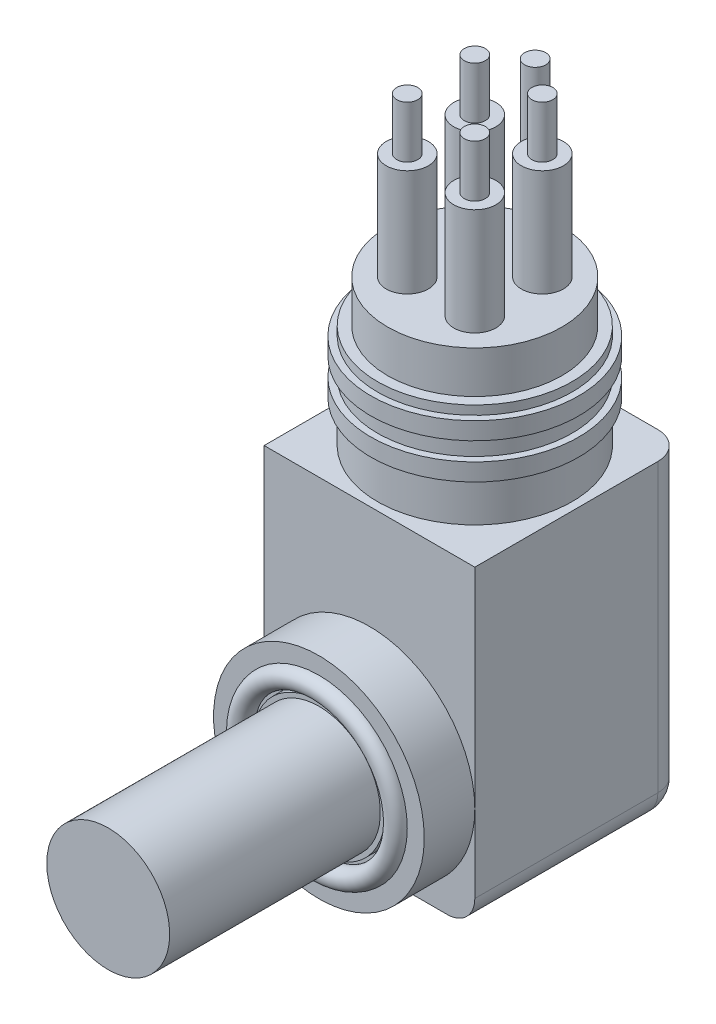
ISO-10303-21;
HEADER;
FILE_DESCRIPTION(('STEP AP214'),'2;1');
FILE_NAME('part.step','',(''),(''),'','','');
FILE_SCHEMA(('AUTOMOTIVE_DESIGN { 1 0 10303 214 1 1 1 1 }'));
ENDSEC;
DATA;
#1=APPLICATION_CONTEXT('core data for automotive mechanical design processes');
#2=APPLICATION_PROTOCOL_DEFINITION('international standard','automotive_design',2000,#1);
#3=PRODUCT_CONTEXT('',#1,'mechanical');
#4=PRODUCT('Part','Part','',(#3));
#5=PRODUCT_RELATED_PRODUCT_CATEGORY('part','',(#4));
#6=PRODUCT_DEFINITION_FORMATION('','',#4);
#7=PRODUCT_DEFINITION_CONTEXT('part definition',#1,'design');
#8=PRODUCT_DEFINITION('design','',#6,#7);
#9=PRODUCT_DEFINITION_SHAPE('','',#8);
#10=(LENGTH_UNIT() NAMED_UNIT(*) SI_UNIT(.MILLI.,.METRE.));
#11=(NAMED_UNIT(*) PLANE_ANGLE_UNIT() SI_UNIT($,.RADIAN.));
#12=(NAMED_UNIT(*) SI_UNIT($,.STERADIAN.) SOLID_ANGLE_UNIT());
#13=UNCERTAINTY_MEASURE_WITH_UNIT(LENGTH_MEASURE(1.E-05),#10,'distance_accuracy_value','');
#14=(GEOMETRIC_REPRESENTATION_CONTEXT(3) GLOBAL_UNCERTAINTY_ASSIGNED_CONTEXT((#13)) GLOBAL_UNIT_ASSIGNED_CONTEXT((#10,
#11,#12)) REPRESENTATION_CONTEXT('',''));
#15=CARTESIAN_POINT('',(0.,0.,0.));
#16=DIRECTION('',(0.,0.,1.));
#17=DIRECTION('',(1.,0.,0.));
#18=AXIS2_PLACEMENT_3D('',#15,#16,#17);
#19=CARTESIAN_POINT('',(0.,9.525,14.097));
#20=DIRECTION('',(0.,0.,1.));
#21=DIRECTION('',(1.,0.,0.));
#22=AXIS2_PLACEMENT_3D('',#19,#20,#21);
#23=PLANE('',#22);
#24=CARTESIAN_POINT('',(0.,9.525,14.097));
#25=DIRECTION('',(0.,0.,1.));
#26=DIRECTION('',(1.,0.,0.));
#27=AXIS2_PLACEMENT_3D('',#24,#25,#26);
#28=CIRCLE('',#27,9.525);
#29=CARTESIAN_POINT('',(9.525,9.525,14.097));
#30=VERTEX_POINT('',#29);
#31=EDGE_CURVE('E143',#30,#30,#28,.T.);
#32=ORIENTED_EDGE('',*,*,#31,.T.);
#33=EDGE_LOOP('',(#32));
#34=FACE_BOUND('',#33,.T.);
#35=CARTESIAN_POINT('',(0.,9.525,14.097));
#36=DIRECTION('',(0.,0.,1.));
#37=DIRECTION('',(1.,0.,0.));
#38=AXIS2_PLACEMENT_3D('',#35,#36,#37);
#39=CIRCLE('',#38,7.99);
#40=CARTESIAN_POINT('',(7.99,9.525,14.097));
#41=VERTEX_POINT('',#40);
#42=EDGE_CURVE('E318',#41,#41,#39,.F.);
#43=ORIENTED_EDGE('',*,*,#42,.T.);
#44=EDGE_LOOP('',(#43));
#45=FACE_BOUND('',#44,.T.);
#46=ADVANCED_FACE('F38',(#34,#45),#23,.T.);
#47=CARTESIAN_POINT('',(-9.525,28.448,9.525));
#48=DIRECTION('',(0.,0.,-1.));
#49=DIRECTION('',(-1.,0.,0.));
#50=AXIS2_PLACEMENT_3D('',#47,#48,#49);
#51=PLANE('',#50);
#52=CARTESIAN_POINT('',(0.,9.525,9.525));
#53=DIRECTION('',(0.,0.,1.));
#54=DIRECTION('',(1.,0.,0.));
#55=AXIS2_PLACEMENT_3D('',#52,#53,#54);
#56=CIRCLE('',#55,9.525);
#57=CARTESIAN_POINT('',(9.525,9.525,9.525));
#58=VERTEX_POINT('',#57);
#59=CARTESIAN_POINT('',(-9.525,9.525,9.525));
#60=VERTEX_POINT('',#59);
#61=EDGE_CURVE('E137',#58,#60,#56,.T.);
#62=ORIENTED_EDGE('',*,*,#61,.F.);
#63=DIRECTION('',(0.,-1.,0.));
#64=VECTOR('',#63,1.);
#65=CARTESIAN_POINT('',(9.525,28.448,9.525));
#66=LINE('',#65,#64);
#67=CARTESIAN_POINT('',(9.525,28.448,9.525));
#68=VERTEX_POINT('',#67);
#69=EDGE_CURVE('E112',#68,#58,#66,.T.);
#70=ORIENTED_EDGE('',*,*,#69,.F.);
#71=DIRECTION('',(1.,0.,0.));
#72=VECTOR('',#71,1.);
#73=CARTESIAN_POINT('',(-9.525,28.448,9.525));
#74=LINE('',#73,#72);
#75=CARTESIAN_POINT('',(-9.525,28.448,9.525));
#76=VERTEX_POINT('',#75);
#77=EDGE_CURVE('E249',#76,#68,#74,.T.);
#78=ORIENTED_EDGE('',*,*,#77,.F.);
#79=DIRECTION('',(0.,-1.,0.));
#80=VECTOR('',#79,1.);
#81=CARTESIAN_POINT('',(-9.525,28.448,9.525));
#82=LINE('',#81,#80);
#83=EDGE_CURVE('E140',#76,#60,#82,.T.);
#84=ORIENTED_EDGE('',*,*,#83,.T.);
#85=EDGE_LOOP('',(#62,#70,#78,#84));
#86=FACE_BOUND('',#85,.T.);
#87=ADVANCED_FACE('F138',(#86),#51,.F.);
#88=CARTESIAN_POINT('',(-9.525,2.5,9.525));
#89=VERTEX_POINT('',#88);
#90=EDGE_CURVE('E123',#60,#89,#82,.T.);
#91=ORIENTED_EDGE('',*,*,#90,.T.);
#92=CARTESIAN_POINT('',(-7.025,2.5,9.525));
#93=DIRECTION('',(0.,0.,-1.));
#94=DIRECTION('',(-1.,0.,0.));
#95=AXIS2_PLACEMENT_3D('',#92,#93,#94);
#96=CIRCLE('',#95,2.5);
#97=CARTESIAN_POINT('',(-7.025,0.,9.525));
#98=VERTEX_POINT('',#97);
#99=EDGE_CURVE('E279',#89,#98,#96,.F.);
#100=ORIENTED_EDGE('',*,*,#99,.T.);
#101=DIRECTION('',(1.,0.,0.));
#102=VECTOR('',#101,1.);
#103=CARTESIAN_POINT('',(-9.525,0.,9.525));
#104=LINE('',#103,#102);
#105=CARTESIAN_POINT('',(0.,0.,9.525));
#106=VERTEX_POINT('',#105);
#107=EDGE_CURVE('E245',#98,#106,#104,.T.);
#108=ORIENTED_EDGE('',*,*,#107,.T.);
#109=EDGE_CURVE('E146',#60,#106,#56,.T.);
#110=ORIENTED_EDGE('',*,*,#109,.F.);
#111=EDGE_LOOP('',(#91,#100,#108,#110));
#112=FACE_BOUND('',#111,.T.);
#113=ADVANCED_FACE('F366',(#112),#51,.F.);
#114=CARTESIAN_POINT('',(7.025,0.,9.525));
#115=VERTEX_POINT('',#114);
#116=EDGE_CURVE('E244',#106,#115,#104,.T.);
#117=ORIENTED_EDGE('',*,*,#116,.T.);
#118=CARTESIAN_POINT('',(7.025,2.5,9.525));
#119=DIRECTION('',(0.,0.,-1.));
#120=DIRECTION('',(-1.,0.,0.));
#121=AXIS2_PLACEMENT_3D('',#118,#119,#120);
#122=CIRCLE('',#121,2.5);
#123=CARTESIAN_POINT('',(9.525,2.5,9.525));
#124=VERTEX_POINT('',#123);
#125=EDGE_CURVE('E133',#115,#124,#122,.F.);
#126=ORIENTED_EDGE('',*,*,#125,.T.);
#127=EDGE_CURVE('E116',#58,#124,#66,.T.);
#128=ORIENTED_EDGE('',*,*,#127,.F.);
#129=EDGE_CURVE('E130',#106,#58,#56,.T.);
#130=ORIENTED_EDGE('',*,*,#129,.F.);
#131=EDGE_LOOP('',(#117,#126,#128,#130));
#132=FACE_BOUND('',#131,.T.);
#133=ADVANCED_FACE('F128',(#132),#51,.F.);
#134=CARTESIAN_POINT('',(0.,41.656,0.));
#135=DIRECTION('',(0.,1.,0.));
#136=DIRECTION('',(-1.,0.,0.));
#137=AXIS2_PLACEMENT_3D('',#134,#135,#136);
#138=PLANE('',#137);
#139=CARTESIAN_POINT('',(3.05328708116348,41.656,3.05328708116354));
#140=DIRECTION('',(0.,1.,0.));
#141=DIRECTION('',(0.,0.,1.));
#142=AXIS2_PLACEMENT_3D('',#139,#140,#141);
#143=CIRCLE('',#142,1.905);
#144=CARTESIAN_POINT('',(3.05328708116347,41.656,4.95828708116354));
#145=VERTEX_POINT('',#144);
#146=EDGE_CURVE('E163',#145,#145,#143,.T.);
#147=ORIENTED_EDGE('',*,*,#146,.F.);
#148=EDGE_LOOP('',(#147));
#149=FACE_BOUND('',#148,.T.);
#150=CARTESIAN_POINT('',(-3.0532870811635,41.656,-3.05328708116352));
#151=DIRECTION('',(0.,1.,0.));
#152=DIRECTION('',(0.,0.,-1.));
#153=AXIS2_PLACEMENT_3D('',#150,#151,#152);
#154=CIRCLE('',#153,1.905);
#155=CARTESIAN_POINT('',(-3.0532870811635,41.656,-4.95828708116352));
#156=VERTEX_POINT('',#155);
#157=EDGE_CURVE('E187',#156,#156,#154,.T.);
#158=ORIENTED_EDGE('',*,*,#157,.F.);
#159=EDGE_LOOP('',(#158));
#160=FACE_BOUND('',#159,.T.);
#161=CARTESIAN_POINT('',(0.,41.656,0.));
#162=DIRECTION('',(0.,1.,0.));
#163=DIRECTION('',(-1.,0.,0.));
#164=AXIS2_PLACEMENT_3D('',#161,#162,#163);
#165=CIRCLE('',#164,7.874);
#166=CARTESIAN_POINT('',(-7.874,41.656,0.));
#167=VERTEX_POINT('',#166);
#168=EDGE_CURVE('E211',#167,#167,#165,.T.);
#169=ORIENTED_EDGE('',*,*,#168,.T.);
#170=EDGE_LOOP('',(#169));
#171=FACE_BOUND('',#170,.T.);
#172=CARTESIAN_POINT('',(-3.05328708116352,41.656,3.05328708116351));
#173=DIRECTION('',(0.,1.,0.));
#174=DIRECTION('',(-1.,0.,0.));
#175=AXIS2_PLACEMENT_3D('',#172,#173,#174);
#176=CIRCLE('',#175,1.905);
#177=CARTESIAN_POINT('',(-4.95828708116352,41.656,3.05328708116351));
#178=VERTEX_POINT('',#177);
#179=EDGE_CURVE('E205',#178,#178,#176,.T.);
#180=ORIENTED_EDGE('',*,*,#179,.F.);
#181=EDGE_LOOP('',(#180));
#182=FACE_BOUND('',#181,.T.);
#183=CARTESIAN_POINT('',(3.05328708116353,41.656,-3.05328708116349));
#184=DIRECTION('',(0.,1.,0.));
#185=DIRECTION('',(1.,0.,0.));
#186=AXIS2_PLACEMENT_3D('',#183,#184,#185);
#187=CIRCLE('',#186,1.905);
#188=CARTESIAN_POINT('',(4.95828708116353,41.656,-3.05328708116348));
#189=VERTEX_POINT('',#188);
#190=EDGE_CURVE('E175',#189,#189,#187,.T.);
#191=ORIENTED_EDGE('',*,*,#190,.F.);
#192=EDGE_LOOP('',(#191));
#193=FACE_BOUND('',#192,.T.);
#194=CARTESIAN_POINT('',(0.,41.656,-5.45820252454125));
#195=DIRECTION('',(0.,1.,0.));
#196=DIRECTION('',(-1.,0.,0.));
#197=AXIS2_PLACEMENT_3D('',#194,#195,#196);
#198=CIRCLE('',#197,0.9525);
#199=CARTESIAN_POINT('',(-0.952500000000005,41.656,-5.45820252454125));
#200=VERTEX_POINT('',#199);
#201=EDGE_CURVE('E157',#200,#200,#198,.T.);
#202=ORIENTED_EDGE('',*,*,#201,.F.);
#203=EDGE_LOOP('',(#202));
#204=FACE_BOUND('',#203,.T.);
#205=ADVANCED_FACE('F517',(#149,#160,#171,#182,#193,#204),#138,.T.);
#206=CARTESIAN_POINT('',(-3.05328708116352,51.308,3.05328708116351));
#207=DIRECTION('',(0.,1.,0.));
#208=DIRECTION('',(-1.,0.,0.));
#209=AXIS2_PLACEMENT_3D('',#206,#207,#208);
#210=PLANE('',#209);
#211=CARTESIAN_POINT('',(-3.05328708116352,51.308,3.05328708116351));
#212=DIRECTION('',(0.,1.,0.));
#213=DIRECTION('',(-1.,0.,0.));
#214=AXIS2_PLACEMENT_3D('',#211,#212,#213);
#215=CIRCLE('',#214,1.905);
#216=CARTESIAN_POINT('',(-4.95828708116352,51.308,3.05328708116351));
#217=VERTEX_POINT('',#216);
#218=EDGE_CURVE('E208',#217,#217,#215,.T.);
#219=ORIENTED_EDGE('',*,*,#218,.T.);
#220=EDGE_LOOP('',(#219));
#221=FACE_BOUND('',#220,.T.);
#222=CARTESIAN_POINT('',(-3.05328708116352,51.308,3.05328708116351));
#223=DIRECTION('',(0.,1.,0.));
#224=DIRECTION('',(-1.,0.,0.));
#225=AXIS2_PLACEMENT_3D('',#222,#223,#224);
#226=CIRCLE('',#225,0.9525);
#227=CARTESIAN_POINT('',(-4.00578708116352,51.308,3.05328708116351));
#228=VERTEX_POINT('',#227);
#229=EDGE_CURVE('E199',#228,#228,#226,.T.);
#230=ORIENTED_EDGE('',*,*,#229,.F.);
#231=EDGE_LOOP('',(#230));
#232=FACE_BOUND('',#231,.T.);
#233=ADVANCED_FACE('F543',(#221,#232),#210,.T.);
#234=CARTESIAN_POINT('',(8.8011,37.846,0.));
#235=DIRECTION('',(0.,-1.,0.));
#236=DIRECTION('',(1.,0.,0.));
#237=AXIS2_PLACEMENT_3D('',#234,#235,#236);
#238=PLANE('',#237);
#239=CARTESIAN_POINT('',(0.,37.846,0.));
#240=DIRECTION('',(0.,1.,0.));
#241=DIRECTION('',(-1.,0.,0.));
#242=AXIS2_PLACEMENT_3D('',#239,#240,#241);
#243=CIRCLE('',#242,8.8011);
#244=CARTESIAN_POINT('',(-8.80110000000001,37.846,0.));
#245=VERTEX_POINT('',#244);
#246=EDGE_CURVE('E241',#245,#245,#243,.T.);
#247=ORIENTED_EDGE('',*,*,#246,.T.);
#248=EDGE_LOOP('',(#247));
#249=FACE_BOUND('',#248,.T.);
#250=CARTESIAN_POINT('',(0.,37.846,0.));
#251=DIRECTION('',(0.,-1.,0.));
#252=DIRECTION('',(1.,0.,0.));
#253=AXIS2_PLACEMENT_3D('',#250,#251,#252);
#254=CIRCLE('',#253,7.874);
#255=CARTESIAN_POINT('',(7.87399999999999,37.846,0.));
#256=VERTEX_POINT('',#255);
#257=EDGE_CURVE('E148',#256,#256,#254,.F.);
#258=ORIENTED_EDGE('',*,*,#257,.F.);
#259=EDGE_LOOP('',(#258));
#260=FACE_BOUND('',#259,.T.);
#261=ADVANCED_FACE('F689',(#249,#260),#238,.F.);
#262=CARTESIAN_POINT('',(-9.525,28.448,-9.525));
#263=DIRECTION('',(0.,1.,0.));
#264=DIRECTION('',(0.,0.,1.));
#265=AXIS2_PLACEMENT_3D('',#262,#263,#264);
#266=PLANE('',#265);
#267=DIRECTION('',(-1.,0.,0.));
#268=VECTOR('',#267,1.);
#269=CARTESIAN_POINT('',(-9.525,28.448,-9.525));
#270=LINE('',#269,#268);
#271=CARTESIAN_POINT('',(7.02499999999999,28.448,-9.525));
#272=VERTEX_POINT('',#271);
#273=CARTESIAN_POINT('',(-7.025,28.448,-9.525));
#274=VERTEX_POINT('',#273);
#275=EDGE_CURVE('E134',#272,#274,#270,.T.);
#276=ORIENTED_EDGE('',*,*,#275,.T.);
#277=CARTESIAN_POINT('',(-7.025,28.448,-7.025));
#278=DIRECTION('',(0.,1.,0.));
#279=DIRECTION('',(0.,0.,1.));
#280=AXIS2_PLACEMENT_3D('',#277,#278,#279);
#281=CIRCLE('',#280,2.5);
#282=CARTESIAN_POINT('',(-9.525,28.448,-7.025));
#283=VERTEX_POINT('',#282);
#284=EDGE_CURVE('E11',#274,#283,#281,.T.);
#285=ORIENTED_EDGE('',*,*,#284,.T.);
#286=DIRECTION('',(0.,0.,1.));
#287=VECTOR('',#286,1.);
#288=CARTESIAN_POINT('',(-9.525,28.448,-9.525));
#289=LINE('',#288,#287);
#290=EDGE_CURVE('E247',#283,#76,#289,.T.);
#291=ORIENTED_EDGE('',*,*,#290,.T.);
#292=ORIENTED_EDGE('',*,*,#77,.T.);
#293=DIRECTION('',(0.,0.,-1.));
#294=VECTOR('',#293,1.);
#295=CARTESIAN_POINT('',(9.525,28.448,-9.525));
#296=LINE('',#295,#294);
#297=CARTESIAN_POINT('',(9.525,28.448,-7.025));
#298=VERTEX_POINT('',#297);
#299=EDGE_CURVE('E119',#68,#298,#296,.T.);
#300=ORIENTED_EDGE('',*,*,#299,.T.);
#301=CARTESIAN_POINT('',(7.025,28.448,-7.025));
#302=DIRECTION('',(0.,1.,0.));
#303=DIRECTION('',(0.,0.,1.));
#304=AXIS2_PLACEMENT_3D('',#301,#302,#303);
#305=CIRCLE('',#304,2.5);
#306=EDGE_CURVE('E46',#298,#272,#305,.T.);
#307=ORIENTED_EDGE('',*,*,#306,.T.);
#308=EDGE_LOOP('',(#276,#285,#291,#292,#300,#307));
#309=FACE_BOUND('',#308,.T.);
#310=CARTESIAN_POINT('',(0.,28.448,0.));
#311=DIRECTION('',(0.,1.,0.));
#312=DIRECTION('',(-1.,0.,0.));
#313=AXIS2_PLACEMENT_3D('',#310,#311,#312);
#314=CIRCLE('',#313,8.8011);
#315=CARTESIAN_POINT('',(-8.80110000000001,28.448,0.));
#316=VERTEX_POINT('',#315);
#317=EDGE_CURVE('E214',#316,#316,#314,.T.);
#318=ORIENTED_EDGE('',*,*,#317,.F.);
#319=EDGE_LOOP('',(#318));
#320=FACE_BOUND('',#319,.T.);
#321=ADVANCED_FACE('F282',(#309,#320),#266,.T.);
#322=CARTESIAN_POINT('',(-9.525,28.448,-9.525));
#323=DIRECTION('',(1.,0.,0.));
#324=DIRECTION('',(0.,0.,-1.));
#325=AXIS2_PLACEMENT_3D('',#322,#323,#324);
#326=PLANE('',#325);
#327=DIRECTION('',(0.,-1.,0.));
#328=VECTOR('',#327,1.);
#329=CARTESIAN_POINT('',(-9.525,28.448,-7.025));
#330=LINE('',#329,#328);
#331=CARTESIAN_POINT('',(-9.525,2.5,-7.025));
#332=VERTEX_POINT('',#331);
#333=EDGE_CURVE('E53',#283,#332,#330,.T.);
#334=ORIENTED_EDGE('',*,*,#333,.T.);
#335=DIRECTION('',(0.,0.,1.));
#336=VECTOR('',#335,1.);
#337=CARTESIAN_POINT('',(-9.525,2.5,-9.525));
#338=LINE('',#337,#336);
#339=EDGE_CURVE('E277',#332,#89,#338,.T.);
#340=ORIENTED_EDGE('',*,*,#339,.T.);
#341=ORIENTED_EDGE('',*,*,#90,.F.);
#342=ORIENTED_EDGE('',*,*,#83,.F.);
#343=ORIENTED_EDGE('',*,*,#290,.F.);
#344=EDGE_LOOP('',(#334,#340,#341,#342,#343));
#345=FACE_BOUND('',#344,.T.);
#346=ADVANCED_FACE('F40',(#345),#326,.F.);
#347=CARTESIAN_POINT('',(9.525,28.448,-9.525));
#348=DIRECTION('',(-1.,0.,0.));
#349=DIRECTION('',(0.,0.,1.));
#350=AXIS2_PLACEMENT_3D('',#347,#348,#349);
#351=PLANE('',#350);
#352=ORIENTED_EDGE('',*,*,#127,.T.);
#353=DIRECTION('',(0.,0.,-1.));
#354=VECTOR('',#353,1.);
#355=CARTESIAN_POINT('',(9.525,2.5,-9.525));
#356=LINE('',#355,#354);
#357=CARTESIAN_POINT('',(9.525,2.5,-7.025));
#358=VERTEX_POINT('',#357);
#359=EDGE_CURVE('E261',#124,#358,#356,.T.);
#360=ORIENTED_EDGE('',*,*,#359,.T.);
#361=DIRECTION('',(0.,-1.,0.));
#362=VECTOR('',#361,1.);
#363=CARTESIAN_POINT('',(9.525,28.448,-7.025));
#364=LINE('',#363,#362);
#365=EDGE_CURVE('E259',#358,#298,#364,.F.);
#366=ORIENTED_EDGE('',*,*,#365,.T.);
#367=ORIENTED_EDGE('',*,*,#299,.F.);
#368=ORIENTED_EDGE('',*,*,#69,.T.);
#369=EDGE_LOOP('',(#352,#360,#366,#367,#368));
#370=FACE_BOUND('',#369,.T.);
#371=ADVANCED_FACE('F114',(#370),#351,.F.);
#372=CARTESIAN_POINT('',(-9.525,28.448,-9.525));
#373=DIRECTION('',(0.,0.,1.));
#374=DIRECTION('',(1.,0.,0.));
#375=AXIS2_PLACEMENT_3D('',#372,#373,#374);
#376=PLANE('',#375);
#377=DIRECTION('',(-1.,0.,0.));
#378=VECTOR('',#377,1.);
#379=CARTESIAN_POINT('',(-9.525,2.5,-9.525));
#380=LINE('',#379,#378);
#381=CARTESIAN_POINT('',(7.025,2.5,-9.525));
#382=VERTEX_POINT('',#381);
#383=CARTESIAN_POINT('',(-7.025,2.5,-9.525));
#384=VERTEX_POINT('',#383);
#385=EDGE_CURVE('E272',#382,#384,#380,.T.);
#386=ORIENTED_EDGE('',*,*,#385,.T.);
#387=DIRECTION('',(0.,-1.,0.));
#388=VECTOR('',#387,1.);
#389=CARTESIAN_POINT('',(-7.025,28.448,-9.525));
#390=LINE('',#389,#388);
#391=EDGE_CURVE('E274',#384,#274,#390,.F.);
#392=ORIENTED_EDGE('',*,*,#391,.T.);
#393=ORIENTED_EDGE('',*,*,#275,.F.);
#394=DIRECTION('',(0.,-1.,0.));
#395=VECTOR('',#394,1.);
#396=CARTESIAN_POINT('',(7.025,28.448,-9.525));
#397=LINE('',#396,#395);
#398=EDGE_CURVE('E270',#272,#382,#397,.T.);
#399=ORIENTED_EDGE('',*,*,#398,.T.);
#400=EDGE_LOOP('',(#386,#392,#393,#399));
#401=FACE_BOUND('',#400,.T.);
#402=ADVANCED_FACE('F288',(#401),#376,.F.);
#403=CARTESIAN_POINT('',(-9.525,0.,-9.525));
#404=DIRECTION('',(0.,1.,0.));
#405=DIRECTION('',(0.,0.,1.));
#406=AXIS2_PLACEMENT_3D('',#403,#404,#405);
#407=PLANE('',#406);
#408=DIRECTION('',(-1.,0.,0.));
#409=VECTOR('',#408,1.);
#410=CARTESIAN_POINT('',(-9.525,0.,-7.025));
#411=LINE('',#410,#409);
#412=CARTESIAN_POINT('',(-7.025,0.,-7.025));
#413=VERTEX_POINT('',#412);
#414=CARTESIAN_POINT('',(7.025,0.,-7.025));
#415=VERTEX_POINT('',#414);
#416=EDGE_CURVE('E265',#413,#415,#411,.F.);
#417=ORIENTED_EDGE('',*,*,#416,.T.);
#418=DIRECTION('',(0.,0.,-1.));
#419=VECTOR('',#418,1.);
#420=CARTESIAN_POINT('',(7.025,0.,-9.52500000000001));
#421=LINE('',#420,#419);
#422=EDGE_CURVE('E267',#415,#115,#421,.F.);
#423=ORIENTED_EDGE('',*,*,#422,.T.);
#424=ORIENTED_EDGE('',*,*,#116,.F.);
#425=ORIENTED_EDGE('',*,*,#107,.F.);
#426=DIRECTION('',(0.,0.,1.));
#427=VECTOR('',#426,1.);
#428=CARTESIAN_POINT('',(-7.025,0.,-9.525));
#429=LINE('',#428,#427);
#430=EDGE_CURVE('E263',#98,#413,#429,.F.);
#431=ORIENTED_EDGE('',*,*,#430,.T.);
#432=EDGE_LOOP('',(#417,#423,#424,#425,#431));
#433=FACE_BOUND('',#432,.T.);
#434=ADVANCED_FACE('F796',(#433),#407,.F.);
#435=CARTESIAN_POINT('',(0.,0.,0.));
#436=DIRECTION('',(0.,1.,0.));
#437=DIRECTION('',(-1.,0.,0.));
#438=AXIS2_PLACEMENT_3D('',#435,#436,#437);
#439=CYLINDRICAL_SURFACE('',#438,8.8011);
#440=ORIENTED_EDGE('',*,*,#246,.F.);
#441=EDGE_LOOP('',(#440));
#442=FACE_BOUND('',#441,.T.);
#443=CARTESIAN_POINT('',(0.,37.0332,0.));
#444=DIRECTION('',(0.,1.,0.));
#445=DIRECTION('',(-1.,0.,0.));
#446=AXIS2_PLACEMENT_3D('',#443,#444,#445);
#447=CIRCLE('',#446,8.8011);
#448=CARTESIAN_POINT('',(-8.80110000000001,37.0332,0.));
#449=VERTEX_POINT('',#448);
#450=EDGE_CURVE('E238',#449,#449,#447,.T.);
#451=ORIENTED_EDGE('',*,*,#450,.T.);
#452=EDGE_LOOP('',(#451));
#453=FACE_BOUND('',#452,.T.);
#454=ADVANCED_FACE('F787',(#442,#453),#439,.T.);
#455=CARTESIAN_POINT('',(9.398,37.0332,0.));
#456=DIRECTION('',(0.,-1.,0.));
#457=DIRECTION('',(1.,0.,0.));
#458=AXIS2_PLACEMENT_3D('',#455,#456,#457);
#459=PLANE('',#458);
#460=ORIENTED_EDGE('',*,*,#450,.F.);
#461=EDGE_LOOP('',(#460));
#462=FACE_BOUND('',#461,.T.);
#463=CARTESIAN_POINT('',(0.,37.0332,0.));
#464=DIRECTION('',(0.,1.,0.));
#465=DIRECTION('',(-1.,0.,0.));
#466=AXIS2_PLACEMENT_3D('',#463,#464,#465);
#467=CIRCLE('',#466,9.398);
#468=CARTESIAN_POINT('',(-9.39800000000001,37.0332,0.));
#469=VERTEX_POINT('',#468);
#470=EDGE_CURVE('E235',#469,#469,#467,.T.);
#471=ORIENTED_EDGE('',*,*,#470,.T.);
#472=EDGE_LOOP('',(#471));
#473=FACE_BOUND('',#472,.T.);
#474=ADVANCED_FACE('F778',(#462,#473),#459,.F.);
#475=CARTESIAN_POINT('',(0.,0.,0.));
#476=DIRECTION('',(0.,1.,0.));
#477=DIRECTION('',(-1.,0.,0.));
#478=AXIS2_PLACEMENT_3D('',#475,#476,#477);
#479=CYLINDRICAL_SURFACE('',#478,9.398);
#480=ORIENTED_EDGE('',*,*,#470,.F.);
#481=EDGE_LOOP('',(#480));
#482=FACE_BOUND('',#481,.T.);
#483=CARTESIAN_POINT('',(0.,35.4584000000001,0.));
#484=DIRECTION('',(0.,1.,0.));
#485=DIRECTION('',(-1.,0.,0.));
#486=AXIS2_PLACEMENT_3D('',#483,#484,#485);
#487=CIRCLE('',#486,9.398);
#488=CARTESIAN_POINT('',(-9.39800000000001,35.4584000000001,0.));
#489=VERTEX_POINT('',#488);
#490=EDGE_CURVE('E232',#489,#489,#487,.T.);
#491=ORIENTED_EDGE('',*,*,#490,.T.);
#492=EDGE_LOOP('',(#491));
#493=FACE_BOUND('',#492,.T.);
#494=ADVANCED_FACE('F769',(#482,#493),#479,.T.);
#495=CARTESIAN_POINT('',(8.8011,35.4584000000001,0.));
#496=DIRECTION('',(0.,1.,0.));
#497=DIRECTION('',(-1.,0.,0.));
#498=AXIS2_PLACEMENT_3D('',#495,#496,#497);
#499=PLANE('',#498);
#500=ORIENTED_EDGE('',*,*,#490,.F.);
#501=EDGE_LOOP('',(#500));
#502=FACE_BOUND('',#501,.T.);
#503=CARTESIAN_POINT('',(0.,35.4584000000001,0.));
#504=DIRECTION('',(0.,1.,0.));
#505=DIRECTION('',(-1.,0.,0.));
#506=AXIS2_PLACEMENT_3D('',#503,#504,#505);
#507=CIRCLE('',#506,8.8011);
#508=CARTESIAN_POINT('',(-8.80110000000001,35.4584000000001,0.));
#509=VERTEX_POINT('',#508);
#510=EDGE_CURVE('E229',#509,#509,#507,.T.);
#511=ORIENTED_EDGE('',*,*,#510,.T.);
#512=EDGE_LOOP('',(#511));
#513=FACE_BOUND('',#512,.T.);
#514=ADVANCED_FACE('F760',(#502,#513),#499,.F.);
#515=CARTESIAN_POINT('',(0.,0.,0.));
#516=DIRECTION('',(0.,1.,0.));
#517=DIRECTION('',(-1.,0.,0.));
#518=AXIS2_PLACEMENT_3D('',#515,#516,#517);
#519=CYLINDRICAL_SURFACE('',#518,8.8011);
#520=ORIENTED_EDGE('',*,*,#510,.F.);
#521=EDGE_LOOP('',(#520));
#522=FACE_BOUND('',#521,.T.);
#523=CARTESIAN_POINT('',(0.,33.8074000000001,0.));
#524=DIRECTION('',(0.,1.,0.));
#525=DIRECTION('',(-1.,0.,0.));
#526=AXIS2_PLACEMENT_3D('',#523,#524,#525);
#527=CIRCLE('',#526,8.8011);
#528=CARTESIAN_POINT('',(-8.8011,33.8074000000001,0.));
#529=VERTEX_POINT('',#528);
#530=EDGE_CURVE('E226',#529,#529,#527,.T.);
#531=ORIENTED_EDGE('',*,*,#530,.T.);
#532=EDGE_LOOP('',(#531));
#533=FACE_BOUND('',#532,.T.);
#534=ADVANCED_FACE('F751',(#522,#533),#519,.T.);
#535=CARTESIAN_POINT('',(9.398,33.8074000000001,0.));
#536=DIRECTION('',(0.,-1.,0.));
#537=DIRECTION('',(1.,0.,0.));
#538=AXIS2_PLACEMENT_3D('',#535,#536,#537);
#539=PLANE('',#538);
#540=ORIENTED_EDGE('',*,*,#530,.F.);
#541=EDGE_LOOP('',(#540));
#542=FACE_BOUND('',#541,.T.);
#543=CARTESIAN_POINT('',(0.,33.8074000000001,0.));
#544=DIRECTION('',(0.,1.,0.));
#545=DIRECTION('',(-1.,0.,0.));
#546=AXIS2_PLACEMENT_3D('',#543,#544,#545);
#547=CIRCLE('',#546,9.398);
#548=CARTESIAN_POINT('',(-9.398,33.8074000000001,0.));
#549=VERTEX_POINT('',#548);
#550=EDGE_CURVE('E223',#549,#549,#547,.T.);
#551=ORIENTED_EDGE('',*,*,#550,.T.);
#552=EDGE_LOOP('',(#551));
#553=FACE_BOUND('',#552,.T.);
#554=ADVANCED_FACE('F742',(#542,#553),#539,.F.);
#555=CARTESIAN_POINT('',(0.,0.,0.));
#556=DIRECTION('',(0.,1.,0.));
#557=DIRECTION('',(-1.,0.,0.));
#558=AXIS2_PLACEMENT_3D('',#555,#556,#557);
#559=CYLINDRICAL_SURFACE('',#558,9.398);
#560=ORIENTED_EDGE('',*,*,#550,.F.);
#561=EDGE_LOOP('',(#560));
#562=FACE_BOUND('',#561,.T.);
#563=CARTESIAN_POINT('',(0.,32.2326000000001,0.));
#564=DIRECTION('',(0.,1.,0.));
#565=DIRECTION('',(-1.,0.,0.));
#566=AXIS2_PLACEMENT_3D('',#563,#564,#565);
#567=CIRCLE('',#566,9.398);
#568=CARTESIAN_POINT('',(-9.398,32.2326000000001,0.));
#569=VERTEX_POINT('',#568);
#570=EDGE_CURVE('E220',#569,#569,#567,.T.);
#571=ORIENTED_EDGE('',*,*,#570,.T.);
#572=EDGE_LOOP('',(#571));
#573=FACE_BOUND('',#572,.T.);
#574=ADVANCED_FACE('F733',(#562,#573),#559,.T.);
#575=CARTESIAN_POINT('',(8.8011,32.2326000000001,0.));
#576=DIRECTION('',(0.,1.,0.));
#577=DIRECTION('',(-1.,0.,0.));
#578=AXIS2_PLACEMENT_3D('',#575,#576,#577);
#579=PLANE('',#578);
#580=ORIENTED_EDGE('',*,*,#570,.F.);
#581=EDGE_LOOP('',(#580));
#582=FACE_BOUND('',#581,.T.);
#583=CARTESIAN_POINT('',(0.,32.2326000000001,0.));
#584=DIRECTION('',(0.,1.,0.));
#585=DIRECTION('',(-1.,0.,0.));
#586=AXIS2_PLACEMENT_3D('',#583,#584,#585);
#587=CIRCLE('',#586,8.8011);
#588=CARTESIAN_POINT('',(-8.80110000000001,32.2326000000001,0.));
#589=VERTEX_POINT('',#588);
#590=EDGE_CURVE('E217',#589,#589,#587,.T.);
#591=ORIENTED_EDGE('',*,*,#590,.T.);
#592=EDGE_LOOP('',(#591));
#593=FACE_BOUND('',#592,.T.);
#594=ADVANCED_FACE('F724',(#582,#593),#579,.F.);
#595=CARTESIAN_POINT('',(0.,0.,0.));
#596=DIRECTION('',(0.,1.,0.));
#597=DIRECTION('',(-1.,0.,0.));
#598=AXIS2_PLACEMENT_3D('',#595,#596,#597);
#599=CYLINDRICAL_SURFACE('',#598,8.8011);
#600=ORIENTED_EDGE('',*,*,#590,.F.);
#601=EDGE_LOOP('',(#600));
#602=FACE_BOUND('',#601,.T.);
#603=ORIENTED_EDGE('',*,*,#317,.T.);
#604=EDGE_LOOP('',(#603));
#605=FACE_BOUND('',#604,.T.);
#606=ADVANCED_FACE('F707',(#602,#605),#599,.T.);
#607=CARTESIAN_POINT('',(0.,41.656,0.));
#608=DIRECTION('',(0.,-1.,0.));
#609=DIRECTION('',(1.,0.,0.));
#610=AXIS2_PLACEMENT_3D('',#607,#608,#609);
#611=CYLINDRICAL_SURFACE('',#610,7.874);
#612=ORIENTED_EDGE('',*,*,#168,.F.);
#613=EDGE_LOOP('',(#612));
#614=FACE_BOUND('',#613,.T.);
#615=ORIENTED_EDGE('',*,*,#257,.T.);
#616=EDGE_LOOP('',(#615));
#617=FACE_BOUND('',#616,.T.);
#618=ADVANCED_FACE('F698',(#614,#617),#611,.T.);
#619=CARTESIAN_POINT('',(-3.05328708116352,51.308,3.05328708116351));
#620=DIRECTION('',(0.,-1.,0.));
#621=DIRECTION('',(1.,0.,0.));
#622=AXIS2_PLACEMENT_3D('',#619,#620,#621);
#623=CYLINDRICAL_SURFACE('',#622,1.905);
#624=ORIENTED_EDGE('',*,*,#218,.F.);
#625=EDGE_LOOP('',(#624));
#626=FACE_BOUND('',#625,.T.);
#627=ORIENTED_EDGE('',*,*,#179,.T.);
#628=EDGE_LOOP('',(#627));
#629=FACE_BOUND('',#628,.T.);
#630=ADVANCED_FACE('F680',(#626,#629),#623,.T.);
#631=CARTESIAN_POINT('',(-3.05328708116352,56.007,3.05328708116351));
#632=DIRECTION('',(0.,-1.,0.));
#633=DIRECTION('',(1.,0.,0.));
#634=AXIS2_PLACEMENT_3D('',#631,#632,#633);
#635=CYLINDRICAL_SURFACE('',#634,0.9525);
#636=CARTESIAN_POINT('',(-3.05328708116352,56.007,3.05328708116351));
#637=DIRECTION('',(0.,1.,0.));
#638=DIRECTION('',(-1.,0.,0.));
#639=AXIS2_PLACEMENT_3D('',#636,#637,#638);
#640=CIRCLE('',#639,0.9525);
#641=CARTESIAN_POINT('',(-4.00578708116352,56.007,3.05328708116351));
#642=VERTEX_POINT('',#641);
#643=EDGE_CURVE('E202',#642,#642,#640,.T.);
#644=ORIENTED_EDGE('',*,*,#643,.F.);
#645=EDGE_LOOP('',(#644));
#646=FACE_BOUND('',#645,.T.);
#647=ORIENTED_EDGE('',*,*,#229,.T.);
#648=EDGE_LOOP('',(#647));
#649=FACE_BOUND('',#648,.T.);
#650=ADVANCED_FACE('F671',(#646,#649),#635,.T.);
#651=CARTESIAN_POINT('',(-3.05328708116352,56.007,3.05328708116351));
#652=DIRECTION('',(0.,1.,0.));
#653=DIRECTION('',(-1.,0.,0.));
#654=AXIS2_PLACEMENT_3D('',#651,#652,#653);
#655=PLANE('',#654);
#656=ORIENTED_EDGE('',*,*,#643,.T.);
#657=EDGE_LOOP('',(#656));
#658=FACE_BOUND('',#657,.T.);
#659=ADVANCED_FACE('F635',(#658),#655,.T.);
#660=CARTESIAN_POINT('',(-3.05328708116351,51.308,-3.05328708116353));
#661=DIRECTION('',(0.,-1.,0.));
#662=DIRECTION('',(0.,0.,1.));
#663=AXIS2_PLACEMENT_3D('',#660,#661,#662);
#664=CYLINDRICAL_SURFACE('',#663,1.905);
#665=CARTESIAN_POINT('',(-3.05328708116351,51.308,-3.05328708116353));
#666=DIRECTION('',(0.,1.,0.));
#667=DIRECTION('',(0.,0.,-1.));
#668=AXIS2_PLACEMENT_3D('',#665,#666,#667);
#669=CIRCLE('',#668,1.905);
#670=CARTESIAN_POINT('',(-3.0532870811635,51.308,-4.95828708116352));
#671=VERTEX_POINT('',#670);
#672=EDGE_CURVE('E196',#671,#671,#669,.T.);
#673=ORIENTED_EDGE('',*,*,#672,.F.);
#674=EDGE_LOOP('',(#673));
#675=FACE_BOUND('',#674,.T.);
#676=ORIENTED_EDGE('',*,*,#157,.T.);
#677=EDGE_LOOP('',(#676));
#678=FACE_BOUND('',#677,.T.);
#679=ADVANCED_FACE('F595',(#675,#678),#664,.T.);
#680=CARTESIAN_POINT('',(-3.05328708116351,51.308,-3.05328708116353));
#681=DIRECTION('',(0.,1.,0.));
#682=DIRECTION('',(0.,0.,-1.));
#683=AXIS2_PLACEMENT_3D('',#680,#681,#682);
#684=PLANE('',#683);
#685=ORIENTED_EDGE('',*,*,#672,.T.);
#686=EDGE_LOOP('',(#685));
#687=FACE_BOUND('',#686,.T.);
#688=CARTESIAN_POINT('',(-3.05328708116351,51.308,-3.05328708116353));
#689=DIRECTION('',(0.,1.,0.));
#690=DIRECTION('',(0.,0.,-1.));
#691=AXIS2_PLACEMENT_3D('',#688,#689,#690);
#692=CIRCLE('',#691,0.9525);
#693=CARTESIAN_POINT('',(-3.0532870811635,51.308,-4.00578708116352));
#694=VERTEX_POINT('',#693);
#695=EDGE_CURVE('E193',#694,#694,#692,.T.);
#696=ORIENTED_EDGE('',*,*,#695,.F.);
#697=EDGE_LOOP('',(#696));
#698=FACE_BOUND('',#697,.T.);
#699=ADVANCED_FACE('F643',(#687,#698),#684,.T.);
#700=CARTESIAN_POINT('',(-3.05328708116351,56.007,-3.05328708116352));
#701=DIRECTION('',(0.,-1.,0.));
#702=DIRECTION('',(0.,0.,1.));
#703=AXIS2_PLACEMENT_3D('',#700,#701,#702);
#704=CYLINDRICAL_SURFACE('',#703,0.9525);
#705=CARTESIAN_POINT('',(-3.05328708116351,56.007,-3.05328708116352));
#706=DIRECTION('',(0.,1.,0.));
#707=DIRECTION('',(0.,0.,-1.));
#708=AXIS2_PLACEMENT_3D('',#705,#706,#707);
#709=CIRCLE('',#708,0.9525);
#710=CARTESIAN_POINT('',(-3.0532870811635,56.007,-4.00578708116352));
#711=VERTEX_POINT('',#710);
#712=EDGE_CURVE('E190',#711,#711,#709,.T.);
#713=ORIENTED_EDGE('',*,*,#712,.F.);
#714=EDGE_LOOP('',(#713));
#715=FACE_BOUND('',#714,.T.);
#716=ORIENTED_EDGE('',*,*,#695,.T.);
#717=EDGE_LOOP('',(#716));
#718=FACE_BOUND('',#717,.T.);
#719=ADVANCED_FACE('F632',(#715,#718),#704,.T.);
#720=CARTESIAN_POINT('',(-3.05328708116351,56.007,-3.05328708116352));
#721=DIRECTION('',(0.,1.,0.));
#722=DIRECTION('',(0.,0.,-1.));
#723=AXIS2_PLACEMENT_3D('',#720,#721,#722);
#724=PLANE('',#723);
#725=ORIENTED_EDGE('',*,*,#712,.T.);
#726=EDGE_LOOP('',(#725));
#727=FACE_BOUND('',#726,.T.);
#728=ADVANCED_FACE('F622',(#727),#724,.T.);
#729=CARTESIAN_POINT('',(3.05328708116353,51.308,-3.05328708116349));
#730=DIRECTION('',(0.,-1.,0.));
#731=DIRECTION('',(-1.,0.,0.));
#732=AXIS2_PLACEMENT_3D('',#729,#730,#731);
#733=CYLINDRICAL_SURFACE('',#732,1.905);
#734=CARTESIAN_POINT('',(3.05328708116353,51.308,-3.05328708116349));
#735=DIRECTION('',(0.,1.,0.));
#736=DIRECTION('',(1.,0.,0.));
#737=AXIS2_PLACEMENT_3D('',#734,#735,#736);
#738=CIRCLE('',#737,1.905);
#739=CARTESIAN_POINT('',(4.95828708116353,51.308,-3.05328708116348));
#740=VERTEX_POINT('',#739);
#741=EDGE_CURVE('E184',#740,#740,#738,.T.);
#742=ORIENTED_EDGE('',*,*,#741,.F.);
#743=EDGE_LOOP('',(#742));
#744=FACE_BOUND('',#743,.T.);
#745=ORIENTED_EDGE('',*,*,#190,.T.);
#746=EDGE_LOOP('',(#745));
#747=FACE_BOUND('',#746,.T.);
#748=ADVANCED_FACE('F555',(#744,#747),#733,.T.);
#749=CARTESIAN_POINT('',(3.05328708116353,51.308,-3.05328708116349));
#750=DIRECTION('',(0.,1.,0.));
#751=DIRECTION('',(1.,0.,0.));
#752=AXIS2_PLACEMENT_3D('',#749,#750,#751);
#753=PLANE('',#752);
#754=ORIENTED_EDGE('',*,*,#741,.T.);
#755=EDGE_LOOP('',(#754));
#756=FACE_BOUND('',#755,.T.);
#757=CARTESIAN_POINT('',(3.05328708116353,51.308,-3.05328708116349));
#758=DIRECTION('',(0.,1.,0.));
#759=DIRECTION('',(1.,0.,0.));
#760=AXIS2_PLACEMENT_3D('',#757,#758,#759);
#761=CIRCLE('',#760,0.9525);
#762=CARTESIAN_POINT('',(4.00578708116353,51.308,-3.05328708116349));
#763=VERTEX_POINT('',#762);
#764=EDGE_CURVE('E181',#763,#763,#761,.T.);
#765=ORIENTED_EDGE('',*,*,#764,.F.);
#766=EDGE_LOOP('',(#765));
#767=FACE_BOUND('',#766,.T.);
#768=ADVANCED_FACE('F603',(#756,#767),#753,.T.);
#769=CARTESIAN_POINT('',(3.05328708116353,56.007,-3.05328708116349));
#770=DIRECTION('',(0.,-1.,0.));
#771=DIRECTION('',(-1.,0.,0.));
#772=AXIS2_PLACEMENT_3D('',#769,#770,#771);
#773=CYLINDRICAL_SURFACE('',#772,0.9525);
#774=CARTESIAN_POINT('',(3.05328708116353,56.007,-3.05328708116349));
#775=DIRECTION('',(0.,1.,0.));
#776=DIRECTION('',(1.,0.,0.));
#777=AXIS2_PLACEMENT_3D('',#774,#775,#776);
#778=CIRCLE('',#777,0.9525);
#779=CARTESIAN_POINT('',(4.00578708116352,56.007,-3.05328708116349));
#780=VERTEX_POINT('',#779);
#781=EDGE_CURVE('E178',#780,#780,#778,.T.);
#782=ORIENTED_EDGE('',*,*,#781,.F.);
#783=EDGE_LOOP('',(#782));
#784=FACE_BOUND('',#783,.T.);
#785=ORIENTED_EDGE('',*,*,#764,.T.);
#786=EDGE_LOOP('',(#785));
#787=FACE_BOUND('',#786,.T.);
#788=ADVANCED_FACE('F592',(#784,#787),#773,.T.);
#789=CARTESIAN_POINT('',(3.05328708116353,56.007,-3.05328708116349));
#790=DIRECTION('',(0.,1.,0.));
#791=DIRECTION('',(1.,0.,0.));
#792=AXIS2_PLACEMENT_3D('',#789,#790,#791);
#793=PLANE('',#792);
#794=ORIENTED_EDGE('',*,*,#781,.T.);
#795=EDGE_LOOP('',(#794));
#796=FACE_BOUND('',#795,.T.);
#797=ADVANCED_FACE('F582',(#796),#793,.T.);
#798=CARTESIAN_POINT('',(3.05328708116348,51.308,3.05328708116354));
#799=DIRECTION('',(0.,-1.,0.));
#800=DIRECTION('',(0.,0.,-1.));
#801=AXIS2_PLACEMENT_3D('',#798,#799,#800);
#802=CYLINDRICAL_SURFACE('',#801,1.905);
#803=CARTESIAN_POINT('',(3.05328708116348,51.308,3.05328708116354));
#804=DIRECTION('',(0.,1.,0.));
#805=DIRECTION('',(0.,0.,1.));
#806=AXIS2_PLACEMENT_3D('',#803,#804,#805);
#807=CIRCLE('',#806,1.905);
#808=CARTESIAN_POINT('',(3.05328708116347,51.308,4.95828708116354));
#809=VERTEX_POINT('',#808);
#810=EDGE_CURVE('E172',#809,#809,#807,.T.);
#811=ORIENTED_EDGE('',*,*,#810,.F.);
#812=EDGE_LOOP('',(#811));
#813=FACE_BOUND('',#812,.T.);
#814=ORIENTED_EDGE('',*,*,#146,.T.);
#815=EDGE_LOOP('',(#814));
#816=FACE_BOUND('',#815,.T.);
#817=ADVANCED_FACE('F536',(#813,#816),#802,.T.);
#818=CARTESIAN_POINT('',(3.05328708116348,51.308,3.05328708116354));
#819=DIRECTION('',(0.,1.,0.));
#820=DIRECTION('',(0.,0.,1.));
#821=AXIS2_PLACEMENT_3D('',#818,#819,#820);
#822=PLANE('',#821);
#823=ORIENTED_EDGE('',*,*,#810,.T.);
#824=EDGE_LOOP('',(#823));
#825=FACE_BOUND('',#824,.T.);
#826=CARTESIAN_POINT('',(3.05328708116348,51.308,3.05328708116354));
#827=DIRECTION('',(0.,1.,0.));
#828=DIRECTION('',(0.,0.,1.));
#829=AXIS2_PLACEMENT_3D('',#826,#827,#828);
#830=CIRCLE('',#829,0.9525);
#831=CARTESIAN_POINT('',(3.05328708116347,51.308,4.00578708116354));
#832=VERTEX_POINT('',#831);
#833=EDGE_CURVE('E169',#832,#832,#830,.T.);
#834=ORIENTED_EDGE('',*,*,#833,.F.);
#835=EDGE_LOOP('',(#834));
#836=FACE_BOUND('',#835,.T.);
#837=ADVANCED_FACE('F563',(#825,#836),#822,.T.);
#838=CARTESIAN_POINT('',(3.05328708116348,56.007,3.05328708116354));
#839=DIRECTION('',(0.,-1.,0.));
#840=DIRECTION('',(0.,0.,-1.));
#841=AXIS2_PLACEMENT_3D('',#838,#839,#840);
#842=CYLINDRICAL_SURFACE('',#841,0.9525);
#843=CARTESIAN_POINT('',(3.05328708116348,56.007,3.05328708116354));
#844=DIRECTION('',(0.,1.,0.));
#845=DIRECTION('',(0.,0.,1.));
#846=AXIS2_PLACEMENT_3D('',#843,#844,#845);
#847=CIRCLE('',#846,0.9525);
#848=CARTESIAN_POINT('',(3.05328708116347,56.007,4.00578708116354));
#849=VERTEX_POINT('',#848);
#850=EDGE_CURVE('E166',#849,#849,#847,.T.);
#851=ORIENTED_EDGE('',*,*,#850,.F.);
#852=EDGE_LOOP('',(#851));
#853=FACE_BOUND('',#852,.T.);
#854=ORIENTED_EDGE('',*,*,#833,.T.);
#855=EDGE_LOOP('',(#854));
#856=FACE_BOUND('',#855,.T.);
#857=ADVANCED_FACE('F552',(#853,#856),#842,.T.);
#858=CARTESIAN_POINT('',(3.05328708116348,56.007,3.05328708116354));
#859=DIRECTION('',(0.,1.,0.));
#860=DIRECTION('',(0.,0.,1.));
#861=AXIS2_PLACEMENT_3D('',#858,#859,#860);
#862=PLANE('',#861);
#863=ORIENTED_EDGE('',*,*,#850,.T.);
#864=EDGE_LOOP('',(#863));
#865=FACE_BOUND('',#864,.T.);
#866=ADVANCED_FACE('F533',(#865),#862,.T.);
#867=CARTESIAN_POINT('',(0.,58.7010768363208,-5.45820252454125));
#868=DIRECTION('',(0.,-1.,0.));
#869=DIRECTION('',(1.,0.,0.));
#870=AXIS2_PLACEMENT_3D('',#867,#868,#869);
#871=CYLINDRICAL_SURFACE('',#870,0.9525);
#872=ORIENTED_EDGE('',*,*,#201,.T.);
#873=EDGE_LOOP('',(#872));
#874=FACE_BOUND('',#873,.T.);
#875=CARTESIAN_POINT('',(0.,56.007,-5.45820252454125));
#876=DIRECTION('',(0.,1.,0.));
#877=DIRECTION('',(-1.,0.,0.));
#878=AXIS2_PLACEMENT_3D('',#875,#876,#877);
#879=CIRCLE('',#878,0.9525);
#880=CARTESIAN_POINT('',(-0.952500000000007,56.007,-5.45820252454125));
#881=VERTEX_POINT('',#880);
#882=EDGE_CURVE('E160',#881,#881,#879,.T.);
#883=ORIENTED_EDGE('',*,*,#882,.F.);
#884=EDGE_LOOP('',(#883));
#885=FACE_BOUND('',#884,.T.);
#886=ADVANCED_FACE('F524',(#874,#885),#871,.T.);
#887=CARTESIAN_POINT('',(-3.05328708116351,56.007,-3.05328708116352));
#888=DIRECTION('',(0.,1.,0.));
#889=DIRECTION('',(0.,0.,-1.));
#890=AXIS2_PLACEMENT_3D('',#887,#888,#889);
#891=PLANE('',#890);
#892=ORIENTED_EDGE('',*,*,#882,.T.);
#893=EDGE_LOOP('',(#892));
#894=FACE_BOUND('',#893,.T.);
#895=ADVANCED_FACE('F354',(#894),#891,.T.);
#896=CARTESIAN_POINT('',(0.,9.525,14.097));
#897=DIRECTION('',(0.,0.,-1.));
#898=DIRECTION('',(-1.,0.,0.));
#899=AXIS2_PLACEMENT_3D('',#896,#897,#898);
#900=CYLINDRICAL_SURFACE('',#899,9.525);
#901=ORIENTED_EDGE('',*,*,#31,.F.);
#902=EDGE_LOOP('',(#901));
#903=FACE_BOUND('',#902,.T.);
#904=ORIENTED_EDGE('',*,*,#61,.T.);
#905=ORIENTED_EDGE('',*,*,#109,.T.);
#906=ORIENTED_EDGE('',*,*,#129,.T.);
#907=EDGE_LOOP('',(#904,#905,#906));
#908=FACE_BOUND('',#907,.T.);
#909=ADVANCED_FACE('F147',(#903,#908),#900,.T.);
#910=CARTESIAN_POINT('',(0.,9.525,14.097));
#911=DIRECTION('',(0.,0.,1.));
#912=DIRECTION('',(1.,0.,0.));
#913=AXIS2_PLACEMENT_3D('',#910,#911,#912);
#914=TOROIDAL_SURFACE('',#913,7.1,0.89);
#915=ORIENTED_EDGE('',*,*,#42,.F.);
#916=EDGE_LOOP('',(#915));
#917=FACE_BOUND('',#916,.T.);
#918=CARTESIAN_POINT('',(0.,9.525,14.0453497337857));
#919=DIRECTION('',(0.,0.,1.));
#920=DIRECTION('',(1.,0.,0.));
#921=AXIS2_PLACEMENT_3D('',#918,#919,#920);
#922=CIRCLE('',#921,7.9885);
#923=CARTESIAN_POINT('',(7.9885,9.525,14.0453497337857));
#924=VERTEX_POINT('',#923);
#925=EDGE_CURVE('E256',#924,#924,#922,.F.);
#926=ORIENTED_EDGE('',*,*,#925,.T.);
#927=EDGE_LOOP('',(#926));
#928=FACE_BOUND('',#927,.T.);
#929=ADVANCED_FACE('F342',(#917,#928),#914,.T.);
#930=CARTESIAN_POINT('',(0.,9.525,33.147));
#931=DIRECTION('',(0.,0.,-1.));
#932=DIRECTION('',(-1.,0.,0.));
#933=AXIS2_PLACEMENT_3D('',#930,#931,#932);
#934=PLANE('',#933);
#935=CARTESIAN_POINT('',(0.,9.525,33.147));
#936=DIRECTION('',(0.,0.,-1.));
#937=DIRECTION('',(-1.,0.,0.));
#938=AXIS2_PLACEMENT_3D('',#935,#936,#937);
#939=CIRCLE('',#938,5.55625);
#940=CARTESIAN_POINT('',(-5.55625,9.525,33.147));
#941=VERTEX_POINT('',#940);
#942=EDGE_CURVE('E321',#941,#941,#939,.T.);
#943=ORIENTED_EDGE('',*,*,#942,.F.);
#944=EDGE_LOOP('',(#943));
#945=FACE_BOUND('',#944,.T.);
#946=ADVANCED_FACE('F344',(#945),#934,.F.);
#947=CARTESIAN_POINT('',(0.,9.525,33.147));
#948=DIRECTION('',(0.,0.,-1.));
#949=DIRECTION('',(-1.,0.,0.));
#950=AXIS2_PLACEMENT_3D('',#947,#948,#949);
#951=CYLINDRICAL_SURFACE('',#950,5.55625);
#952=CARTESIAN_POINT('',(0.,9.525,14.097));
#953=DIRECTION('',(0.,0.,1.));
#954=DIRECTION('',(1.,0.,0.));
#955=AXIS2_PLACEMENT_3D('',#952,#953,#954);
#956=CIRCLE('',#955,5.55625);
#957=CARTESIAN_POINT('',(-5.55625,9.525,14.097));
#958=VERTEX_POINT('',#957);
#959=EDGE_CURVE('E149',#958,#958,#956,.T.);
#960=CARTESIAN_POINT('',(-5.55625,9.525,33.147));
#961=CARTESIAN_POINT('',(-5.55625,9.525,32.9485625));
#962=CARTESIAN_POINT('',(-5.55625,9.525,32.750125));
#963=CARTESIAN_POINT('',(-5.55625,9.525,32.35325));
#964=CARTESIAN_POINT('',(-5.55625,9.525,32.1548125));
#965=CARTESIAN_POINT('',(-5.55625,9.525,31.7579375));
#966=CARTESIAN_POINT('',(-5.55625,9.525,31.5595));
#967=CARTESIAN_POINT('',(-5.55625,9.525,31.162625));
#968=CARTESIAN_POINT('',(-5.55625,9.525,30.9641875));
#969=CARTESIAN_POINT('',(-5.55625,9.525,30.5673125));
#970=CARTESIAN_POINT('',(-5.55625,9.525,30.368875));
#971=CARTESIAN_POINT('',(-5.55625,9.525,29.972));
#972=CARTESIAN_POINT('',(-5.55625,9.525,29.7735625));
#973=CARTESIAN_POINT('',(-5.55625,9.525,29.3766875));
#974=CARTESIAN_POINT('',(-5.55625,9.525,29.17825));
#975=CARTESIAN_POINT('',(-5.55625,9.525,28.781375));
#976=CARTESIAN_POINT('',(-5.55625,9.525,28.5829375));
#977=CARTESIAN_POINT('',(-5.55625,9.525,28.1860625));
#978=CARTESIAN_POINT('',(-5.55625,9.525,27.987625));
#979=CARTESIAN_POINT('',(-5.55625,9.525,27.59075));
#980=CARTESIAN_POINT('',(-5.55625,9.525,27.3923125));
#981=CARTESIAN_POINT('',(-5.55625,9.525,26.9954375));
#982=CARTESIAN_POINT('',(-5.55625,9.525,26.797));
#983=CARTESIAN_POINT('',(-5.55625,9.525,26.400125));
#984=CARTESIAN_POINT('',(-5.55625,9.525,26.2016875));
#985=CARTESIAN_POINT('',(-5.55625,9.525,25.8048125));
#986=CARTESIAN_POINT('',(-5.55625,9.525,25.606375));
#987=CARTESIAN_POINT('',(-5.55625,9.525,25.2095));
#988=CARTESIAN_POINT('',(-5.55625,9.525,25.0110625));
#989=CARTESIAN_POINT('',(-5.55625,9.525,24.6141875));
#990=CARTESIAN_POINT('',(-5.55625,9.525,24.41575));
#991=CARTESIAN_POINT('',(-5.55625,9.525,24.018875));
#992=CARTESIAN_POINT('',(-5.55625,9.525,23.8204375));
#993=CARTESIAN_POINT('',(-5.55625,9.525,23.4235625));
#994=CARTESIAN_POINT('',(-5.55625,9.525,23.225125));
#995=CARTESIAN_POINT('',(-5.55625,9.525,22.82825));
#996=CARTESIAN_POINT('',(-5.55625,9.525,22.6298125));
#997=CARTESIAN_POINT('',(-5.55625,9.525,22.2329375));
#998=CARTESIAN_POINT('',(-5.55625,9.525,22.0345));
#999=CARTESIAN_POINT('',(-5.55625,9.525,21.637625));
#1000=CARTESIAN_POINT('',(-5.55625,9.525,21.4391875));
#1001=CARTESIAN_POINT('',(-5.55625,9.525,21.0423125));
#1002=CARTESIAN_POINT('',(-5.55625,9.525,20.843875));
#1003=CARTESIAN_POINT('',(-5.55625,9.525,20.447));
#1004=CARTESIAN_POINT('',(-5.55625,9.525,20.2485625));
#1005=CARTESIAN_POINT('',(-5.55625,9.525,19.8516875));
#1006=CARTESIAN_POINT('',(-5.55625,9.525,19.65325));
#1007=CARTESIAN_POINT('',(-5.55625,9.525,19.256375));
#1008=CARTESIAN_POINT('',(-5.55625,9.525,19.0579375));
#1009=CARTESIAN_POINT('',(-5.55625,9.525,18.6610625));
#1010=CARTESIAN_POINT('',(-5.55625,9.525,18.462625));
#1011=CARTESIAN_POINT('',(-5.55625,9.525,18.06575));
#1012=CARTESIAN_POINT('',(-5.55625,9.525,17.8673125));
#1013=CARTESIAN_POINT('',(-5.55625,9.525,17.4704375));
#1014=CARTESIAN_POINT('',(-5.55625,9.525,17.272));
#1015=CARTESIAN_POINT('',(-5.55625,9.525,16.875125));
#1016=CARTESIAN_POINT('',(-5.55625,9.525,16.6766875));
#1017=CARTESIAN_POINT('',(-5.55625,9.525,16.2798125));
#1018=CARTESIAN_POINT('',(-5.55625,9.525,16.081375));
#1019=CARTESIAN_POINT('',(-5.55625,9.525,15.6845));
#1020=CARTESIAN_POINT('',(-5.55625,9.525,15.4860625));
#1021=CARTESIAN_POINT('',(-5.55625,9.525,15.0891875));
#1022=CARTESIAN_POINT('',(-5.55625,9.525,14.89075));
#1023=CARTESIAN_POINT('',(-5.55625,9.525,14.493875));
#1024=CARTESIAN_POINT('',(-5.55625,9.525,14.2954375));
#1025=CARTESIAN_POINT('',(-5.55625,9.525,14.097));
#1026=B_SPLINE_CURVE_WITH_KNOTS('',3,(#960,#961,#962,#963,#964,#965,#966,#967,#968,#969,#970,
#971,#972,#973,#974,#975,#976,#977,#978,#979,#980,#981,#982,#983,#984,#985,#986,#987,#988,#989,
#990,#991,#992,#993,#994,#995,#996,#997,#998,#999,#1000,#1001,#1002,#1003,#1004,#1005,#1006,
#1007,#1008,#1009,#1010,#1011,#1012,#1013,#1014,#1015,#1016,#1017,#1018,#1019,#1020,#1021,#1022,
#1023,#1024,#1025),.UNSPECIFIED.,.F.,.F.,(4,2,2,2,2,2,2,2,2,2,2,2,2,2,2,2,2,2,2,2,2,2,2,2,2,2,2,
2,2,2,2,2,4),(0.,0.595312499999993,1.19062499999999,1.78593749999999,2.38125,2.9765625,3.571875,
4.1671875,4.7625,5.3578125,5.953125,6.5484375,7.14375,7.7390625,8.334375,8.9296875,9.525,
10.1203125,10.715625,11.3109375,11.90625,12.5015625,13.096875,13.6921875,14.2875,14.8828125,
15.478125,16.0734375,16.66875,17.2640625,17.859375,18.4546875,19.05),.UNSPECIFIED.);
#1027=EDGE_CURVE('BSEAM351',#941,#958,#1026,.T.);
#1028=ORIENTED_EDGE('',*,*,#942,.T.);
#1029=ORIENTED_EDGE('',*,*,#959,.T.);
#1030=ORIENTED_EDGE('',*,*,#1027,.T.);
#1031=ORIENTED_EDGE('',*,*,#1027,.F.);
#1032=EDGE_LOOP('',(#1028,#1030,#1029,#1031));
#1033=FACE_BOUND('',#1032,.T.);
#1034=ADVANCED_FACE('F351',(#1033),#951,.T.);
#1035=ORIENTED_EDGE('',*,*,#959,.F.);
#1036=EDGE_LOOP('',(#1035));
#1037=FACE_BOUND('',#1036,.T.);
#1038=CARTESIAN_POINT('',(0.,9.525,14.097));
#1039=DIRECTION('',(0.,0.,1.));
#1040=DIRECTION('',(1.,0.,0.));
#1041=AXIS2_PLACEMENT_3D('',#1038,#1039,#1040);
#1042=CIRCLE('',#1041,5.9565);
#1043=CARTESIAN_POINT('',(5.9565,9.525,14.097));
#1044=VERTEX_POINT('',#1043);
#1045=EDGE_CURVE('E324',#1044,#1044,#1042,.T.);
#1046=ORIENTED_EDGE('',*,*,#1045,.T.);
#1047=EDGE_LOOP('',(#1046));
#1048=FACE_BOUND('',#1047,.T.);
#1049=ADVANCED_FACE('F362',(#1037,#1048),#23,.T.);
#1050=CARTESIAN_POINT('',(0.,9.525,12.827));
#1051=DIRECTION('',(0.,0.,1.));
#1052=DIRECTION('',(1.,0.,0.));
#1053=AXIS2_PLACEMENT_3D('',#1050,#1051,#1052);
#1054=CYLINDRICAL_SURFACE('',#1053,5.9565);
#1055=CARTESIAN_POINT('',(0.,9.525,12.827));
#1056=DIRECTION('',(0.,0.,1.));
#1057=DIRECTION('',(1.,0.,0.));
#1058=AXIS2_PLACEMENT_3D('',#1055,#1056,#1057);
#1059=CIRCLE('',#1058,5.9565);
#1060=CARTESIAN_POINT('',(5.9565,9.525,12.827));
#1061=VERTEX_POINT('',#1060);
#1062=EDGE_CURVE('E326',#1061,#1061,#1059,.T.);
#1063=ORIENTED_EDGE('',*,*,#1062,.T.);
#1064=EDGE_LOOP('',(#1063));
#1065=FACE_BOUND('',#1064,.T.);
#1066=ORIENTED_EDGE('',*,*,#1045,.F.);
#1067=EDGE_LOOP('',(#1066));
#1068=FACE_BOUND('',#1067,.T.);
#1069=ADVANCED_FACE('F369',(#1065,#1068),#1054,.T.);
#1070=CARTESIAN_POINT('',(0.,9.525,12.827));
#1071=DIRECTION('',(0.,0.,1.));
#1072=DIRECTION('',(1.,0.,0.));
#1073=AXIS2_PLACEMENT_3D('',#1070,#1071,#1072);
#1074=PLANE('',#1073);
#1075=ORIENTED_EDGE('',*,*,#1062,.F.);
#1076=EDGE_LOOP('',(#1075));
#1077=FACE_BOUND('',#1076,.T.);
#1078=CARTESIAN_POINT('',(0.,9.525,12.827));
#1079=DIRECTION('',(0.,0.,1.));
#1080=DIRECTION('',(1.,0.,0.));
#1081=AXIS2_PLACEMENT_3D('',#1078,#1079,#1080);
#1082=CIRCLE('',#1081,7.9885);
#1083=CARTESIAN_POINT('',(7.9885,9.525,12.827));
#1084=VERTEX_POINT('',#1083);
#1085=EDGE_CURVE('E144',#1084,#1084,#1082,.T.);
#1086=ORIENTED_EDGE('',*,*,#1085,.T.);
#1087=EDGE_LOOP('',(#1086));
#1088=FACE_BOUND('',#1087,.T.);
#1089=ADVANCED_FACE('F333',(#1077,#1088),#1074,.T.);
#1090=CARTESIAN_POINT('',(0.,9.525,12.827));
#1091=DIRECTION('',(0.,0.,1.));
#1092=DIRECTION('',(1.,0.,0.));
#1093=AXIS2_PLACEMENT_3D('',#1090,#1091,#1092);
#1094=CYLINDRICAL_SURFACE('',#1093,7.9885);
#1095=ORIENTED_EDGE('',*,*,#1085,.F.);
#1096=EDGE_LOOP('',(#1095));
#1097=FACE_BOUND('',#1096,.T.);
#1098=ORIENTED_EDGE('',*,*,#925,.F.);
#1099=EDGE_LOOP('',(#1098));
#1100=FACE_BOUND('',#1099,.T.);
#1101=ADVANCED_FACE('F335',(#1097,#1100),#1094,.F.);
#1102=CARTESIAN_POINT('',(-7.025,28.448,-7.025));
#1103=DIRECTION('',(0.,-1.,0.));
#1104=DIRECTION('',(0.,0.,-1.));
#1105=AXIS2_PLACEMENT_3D('',#1102,#1103,#1104);
#1106=CYLINDRICAL_SURFACE('',#1105,2.5);
#1107=ORIENTED_EDGE('',*,*,#284,.F.);
#1108=ORIENTED_EDGE('',*,*,#391,.F.);
#1109=CARTESIAN_POINT('',(-7.025,2.5,-7.025));
#1110=DIRECTION('',(0.,-1.,0.));
#1111=DIRECTION('',(0.,0.,-1.));
#1112=AXIS2_PLACEMENT_3D('',#1109,#1110,#1111);
#1113=CIRCLE('',#1112,2.5);
#1114=EDGE_CURVE('E315',#332,#384,#1113,.T.);
#1115=ORIENTED_EDGE('',*,*,#1114,.F.);
#1116=ORIENTED_EDGE('',*,*,#333,.F.);
#1117=EDGE_LOOP('',(#1107,#1108,#1115,#1116));
#1118=FACE_BOUND('',#1117,.T.);
#1119=ADVANCED_FACE('F338',(#1118),#1106,.T.);
#1120=CARTESIAN_POINT('',(-7.025,2.5,-9.525));
#1121=DIRECTION('',(0.,0.,1.));
#1122=DIRECTION('',(1.,0.,0.));
#1123=AXIS2_PLACEMENT_3D('',#1120,#1121,#1122);
#1124=CYLINDRICAL_SURFACE('',#1123,2.5);
#1125=ORIENTED_EDGE('',*,*,#99,.F.);
#1126=ORIENTED_EDGE('',*,*,#339,.F.);
#1127=CARTESIAN_POINT('',(-7.025,2.5,-7.025));
#1128=DIRECTION('',(0.,0.,-1.));
#1129=DIRECTION('',(-1.,0.,0.));
#1130=AXIS2_PLACEMENT_3D('',#1127,#1128,#1129);
#1131=CIRCLE('',#1130,2.5);
#1132=EDGE_CURVE('E312',#413,#332,#1131,.T.);
#1133=ORIENTED_EDGE('',*,*,#1132,.F.);
#1134=ORIENTED_EDGE('',*,*,#430,.F.);
#1135=EDGE_LOOP('',(#1125,#1126,#1133,#1134));
#1136=FACE_BOUND('',#1135,.T.);
#1137=ADVANCED_FACE('F404',(#1136),#1124,.T.);
#1138=CARTESIAN_POINT('',(-7.025,2.5,-7.025));
#1139=DIRECTION('',(0.,0.,1.));
#1140=DIRECTION('',(1.,0.,0.));
#1141=AXIS2_PLACEMENT_3D('',#1138,#1139,#1140);
#1142=SPHERICAL_SURFACE('',#1141,2.5);
#1143=ORIENTED_EDGE('',*,*,#1132,.T.);
#1144=ORIENTED_EDGE('',*,*,#1114,.T.);
#1145=CARTESIAN_POINT('',(-7.025,2.5,-7.025));
#1146=DIRECTION('',(-1.,0.,0.));
#1147=DIRECTION('',(0.,0.,1.));
#1148=AXIS2_PLACEMENT_3D('',#1145,#1146,#1147);
#1149=CIRCLE('',#1148,2.5);
#1150=EDGE_CURVE('E298',#413,#384,#1149,.F.);
#1151=ORIENTED_EDGE('',*,*,#1150,.F.);
#1152=EDGE_LOOP('',(#1143,#1144,#1151));
#1153=FACE_BOUND('',#1152,.T.);
#1154=ADVANCED_FACE('F412',(#1153),#1142,.T.);
#1155=CARTESIAN_POINT('',(7.025,28.448,-7.025));
#1156=DIRECTION('',(0.,-1.,0.));
#1157=DIRECTION('',(0.,0.,-1.));
#1158=AXIS2_PLACEMENT_3D('',#1155,#1156,#1157);
#1159=CYLINDRICAL_SURFACE('',#1158,2.5);
#1160=ORIENTED_EDGE('',*,*,#306,.F.);
#1161=ORIENTED_EDGE('',*,*,#365,.F.);
#1162=CARTESIAN_POINT('',(7.025,2.5,-7.025));
#1163=DIRECTION('',(0.,-1.,0.));
#1164=DIRECTION('',(0.,0.,-1.));
#1165=AXIS2_PLACEMENT_3D('',#1162,#1163,#1164);
#1166=CIRCLE('',#1165,2.5);
#1167=EDGE_CURVE('E294',#382,#358,#1166,.T.);
#1168=ORIENTED_EDGE('',*,*,#1167,.F.);
#1169=ORIENTED_EDGE('',*,*,#398,.F.);
#1170=EDGE_LOOP('',(#1160,#1161,#1168,#1169));
#1171=FACE_BOUND('',#1170,.T.);
#1172=ADVANCED_FACE('F292',(#1171),#1159,.T.);
#1173=CARTESIAN_POINT('',(-9.525,2.5,-7.025));
#1174=DIRECTION('',(-1.,0.,0.));
#1175=DIRECTION('',(0.,0.,1.));
#1176=AXIS2_PLACEMENT_3D('',#1173,#1174,#1175);
#1177=CYLINDRICAL_SURFACE('',#1176,2.5);
#1178=ORIENTED_EDGE('',*,*,#1150,.T.);
#1179=ORIENTED_EDGE('',*,*,#385,.F.);
#1180=CARTESIAN_POINT('',(7.025,2.5,-7.025));
#1181=DIRECTION('',(1.,0.,0.));
#1182=DIRECTION('',(0.,0.,-1.));
#1183=AXIS2_PLACEMENT_3D('',#1180,#1181,#1182);
#1184=CIRCLE('',#1183,2.5);
#1185=EDGE_CURVE('E299',#415,#382,#1184,.T.);
#1186=ORIENTED_EDGE('',*,*,#1185,.F.);
#1187=ORIENTED_EDGE('',*,*,#416,.F.);
#1188=EDGE_LOOP('',(#1178,#1179,#1186,#1187));
#1189=FACE_BOUND('',#1188,.T.);
#1190=ADVANCED_FACE('F427',(#1189),#1177,.T.);
#1191=CARTESIAN_POINT('',(7.025,2.5,-7.025));
#1192=DIRECTION('',(0.,0.,1.));
#1193=DIRECTION('',(1.,0.,0.));
#1194=AXIS2_PLACEMENT_3D('',#1191,#1192,#1193);
#1195=SPHERICAL_SURFACE('',#1194,2.5);
#1196=ORIENTED_EDGE('',*,*,#1185,.T.);
#1197=ORIENTED_EDGE('',*,*,#1167,.T.);
#1198=CARTESIAN_POINT('',(7.025,2.5,-7.025));
#1199=DIRECTION('',(0.,0.,-1.));
#1200=DIRECTION('',(-1.,0.,0.));
#1201=AXIS2_PLACEMENT_3D('',#1198,#1199,#1200);
#1202=CIRCLE('',#1201,2.5);
#1203=EDGE_CURVE('E303',#415,#358,#1202,.F.);
#1204=ORIENTED_EDGE('',*,*,#1203,.F.);
#1205=EDGE_LOOP('',(#1196,#1197,#1204));
#1206=FACE_BOUND('',#1205,.T.);
#1207=ADVANCED_FACE('F302',(#1206),#1195,.T.);
#1208=CARTESIAN_POINT('',(7.025,2.5,-9.525));
#1209=DIRECTION('',(0.,0.,-1.));
#1210=DIRECTION('',(-1.,0.,0.));
#1211=AXIS2_PLACEMENT_3D('',#1208,#1209,#1210);
#1212=CYLINDRICAL_SURFACE('',#1211,2.5);
#1213=ORIENTED_EDGE('',*,*,#125,.F.);
#1214=ORIENTED_EDGE('',*,*,#422,.F.);
#1215=ORIENTED_EDGE('',*,*,#1203,.T.);
#1216=ORIENTED_EDGE('',*,*,#359,.F.);
#1217=EDGE_LOOP('',(#1213,#1214,#1215,#1216));
#1218=FACE_BOUND('',#1217,.T.);
#1219=ADVANCED_FACE('F440',(#1218),#1212,.T.);
#1220=CLOSED_SHELL('',(#46,#87,#113,#133,#205,#233,#261,#321,#346,#371,#402,#434,#454,#474,#494,
#514,#534,#554,#574,#594,#606,#618,#630,#650,#659,#679,#699,#719,#728,#748,#768,#788,#797,#817,
#837,#857,#866,#886,#895,#909,#929,#946,#1034,#1049,#1069,#1089,#1101,#1119,#1137,#1154,#1172,
#1190,#1207,#1219));
#1221=MANIFOLD_SOLID_BREP('B2',#1220);
#1222=ADVANCED_BREP_SHAPE_REPRESENTATION('',(#18,#1221),#14);
#1223=SHAPE_DEFINITION_REPRESENTATION(#9,#1222);
ENDSEC;
END-ISO-10303-21;
